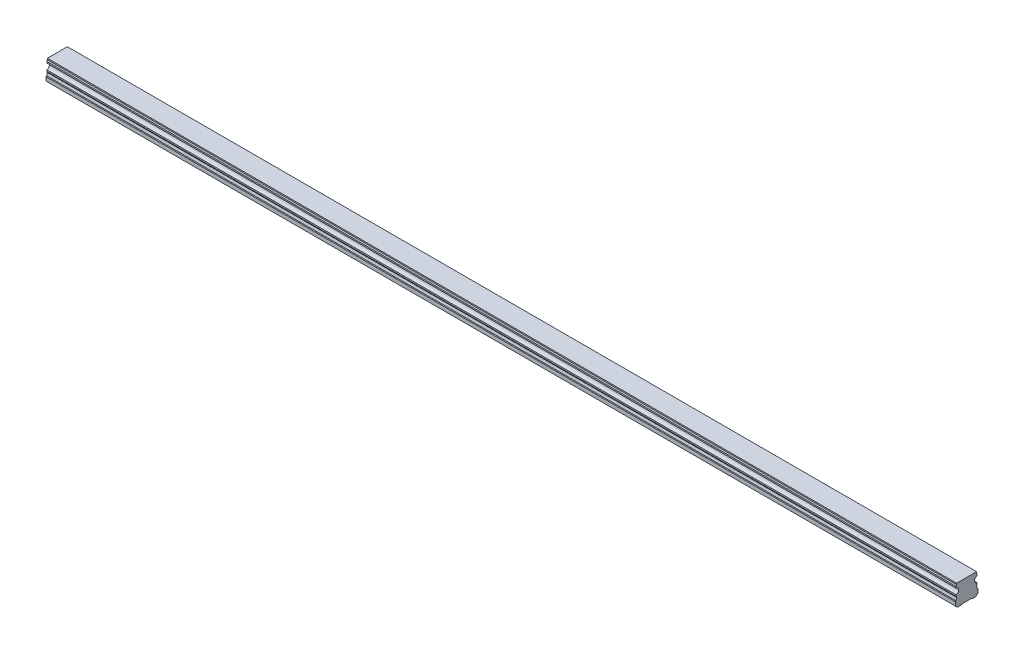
from build123d import *

# Parameters (mm, degrees)
BOSS_EXTRUDE1_DEPTH        = 600
SKETCH3_R                  = 2.5
SKETCH3_R_2                = 2.1
CUT_EXTRUDE3_DEPTH         = 7
SKETCH3_2_R                = 2.1
CUT_EXTRUDE4_DEPTH         = 9.5
CHAMFER1_SIZE              = 0.4
LPATTERN2_COUNT            = 10
LPATTERN2_PITCH            = 60
CHAMFER1_OF_LPATTERN2_SIZE = 0.4


with BuildPart() as part:
    # Sketch1 → Boss-Extrude1 (new body)
    with BuildSketch(Plane(origin=(0, 0, 0), x_dir=(0, 0, -1), z_dir=(1, 0, 0))):
        with BuildLine():
            Line((6.59, 14), (-6.59, 14))
            Line((-6.59, 14), (-6.59, 13.15))
            Line((-6.59, 13.15), (-6.96, 12.356532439))
            Line((-6.96, 12.356532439), (-6.96, 11.435174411))
            ThreePointArc((-6.96, 11.435174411), (-5.25, 9.5), (-6.96, 7.564825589))
            Line((-6.96, 7.564825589), (-6.96, 6.643467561))
            Line((-6.96, 6.643467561), (-6.59, 5.85))
            Line((-6.59, 5.85), (-7.032116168, 4.2))
            Line((-7.032116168, 4.2), (-7.5, 3.929867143))
            Line((-7.5, 3.929867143), (-7.5, 1.4))
            Line((-7.5, 1.4), (-6.1, 0))
            Line((-6.1, 0), (-3.65, 0))
            Line((-3.65, 0), (-3.25, 0.4))
            Line((-3.25, 0.4), (3.25, 0.4))
            Line((3.25, 0.4), (3.65, 0))
            Line((3.65, 0), (6.1, 0))
            Line((6.1, 0), (7.5, 1.4))
            Line((7.5, 1.4), (7.5, 3.929867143))
            Line((7.5, 3.929867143), (7.032116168, 4.2))
            Line((7.032116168, 4.2), (6.59, 5.85))
            Line((6.59, 5.85), (6.96, 6.643467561))
            Line((6.96, 6.643467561), (6.96, 7.564825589))
            ThreePointArc((6.96, 7.564825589), (5.25, 9.5), (6.96, 11.435174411))
            Line((6.96, 11.435174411), (6.96, 12.356532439))
            Line((6.96, 12.356532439), (6.59, 13.15))
            Line((6.59, 13.15), (6.59, 14))
        make_face()
    extrude(amount=BOSS_EXTRUDE1_DEPTH)

    # Sketch3 → Cut-Extrude3 (cut)
    with BuildSketch(Plane.XZ):
        with Locations(Location((30, 0, 0), (0, 0, 270))):
            Circle(SKETCH3_R)
        with Locations(Location((30, 0, 0), (0, 0, 270))):
            Circle(SKETCH3_R_2, mode=Mode.SUBTRACT)
    cut_extrude3 = extrude(amount=-CUT_EXTRUDE3_DEPTH, mode=Mode.SUBTRACT)

    # Sketch3_2 → Cut-Extrude4 (cut)
    with BuildSketch(Plane.XZ):
        with Locations(Location((30, 0, 0), (0, 0, 270))):
            Circle(SKETCH3_2_R)
    cut_extrude4 = extrude(amount=-CUT_EXTRUDE4_DEPTH, mode=Mode.SUBTRACT)

    # Cut-Extrude5 cone 1 section (on through the dimple's axis) → Cut-Extrude5 (revolve, cut)
    with BuildSketch(Plane(origin=(30, 9.5, 0), x_dir=(0, 0, -1), z_dir=(1, 0, 0))):
        Polygon((0, 0), (2.1, 0), (0, 1.212435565), align=None)
    revolve(axis=Axis((30, 9.5, 0), (0, 1, 0)), mode=Mode.SUBTRACT)

    # Chamfer1
    chamfer1_edges = [part.edges().sort_by_distance(p)[0] for p in [
        (30, 0.4, 2.5),
    ]]
    chamfer(chamfer1_edges, length=CHAMFER1_SIZE)

    # LPattern2: Cut-Extrude3, Cut-Extrude4 ×10
    with Locations(*[(i * LPATTERN2_PITCH, 0, 0) for i in range(1, LPATTERN2_COUNT)]):
        add(cut_extrude3, mode=Mode.SUBTRACT)
        add(cut_extrude4, mode=Mode.SUBTRACT)

    # Chamfer1 of LPattern2
    chamfer1_of_lpattern2_edges = [part.edges().sort_by_distance(p)[0] for p in [
        (90, 0.4, 2.5),
        (150, 0.4, 2.5),
        (210, 0.4, 2.5),
        (270, 0.4, 2.5),
        (330, 0.4, 2.5),
        (390, 0.4, 2.5),
        (450, 0.4, 2.5),
        (510, 0.4, 2.5),
        (570, 0.4, 2.5),
    ]]
    chamfer(chamfer1_of_lpattern2_edges, length=CHAMFER1_OF_LPATTERN2_SIZE)


solid = part.part
